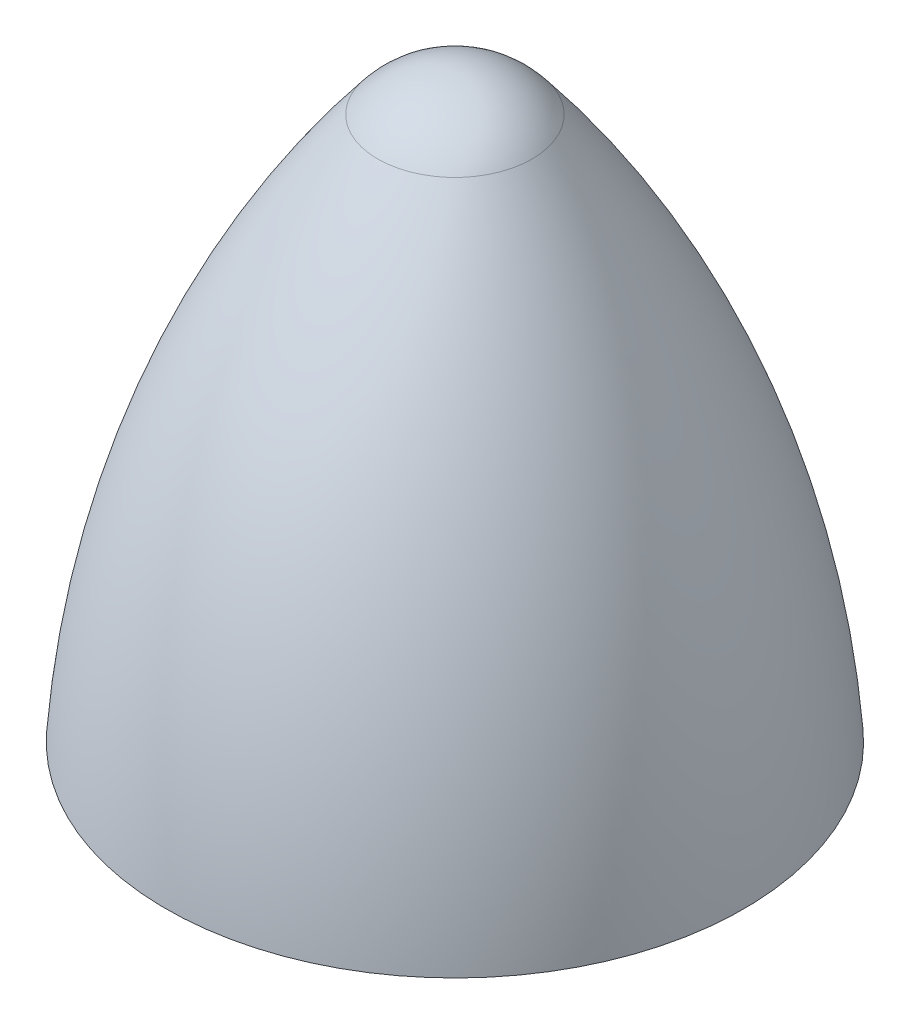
from build123d import *


with BuildPart() as part:
    # Esquisse1 → R_volution2 (revolve)
    with BuildSketch(Plane.XY, mode=Mode.PRIVATE) as r_volution2_sk:
        with BuildLine():
            Line((0, 0), (10.5, 0))
            ThreePointArc((10.5, 0), (8.15170042, 10.458986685), (2.807154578, 19.750958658))
            ThreePointArc((2.807154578, 19.750958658), (1.558107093, 20.748077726), (0, 21.103982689))
            Line((0, 21.103982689), (0, 0))
        make_face()
    revolve(r_volution2_sk.sketch.rotate(Axis((0, 21.103982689, 0), (0, -1, 0)), 180), axis=Axis((0, 21.103982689, 0), (0, -1, 0)))


solid = part.part
